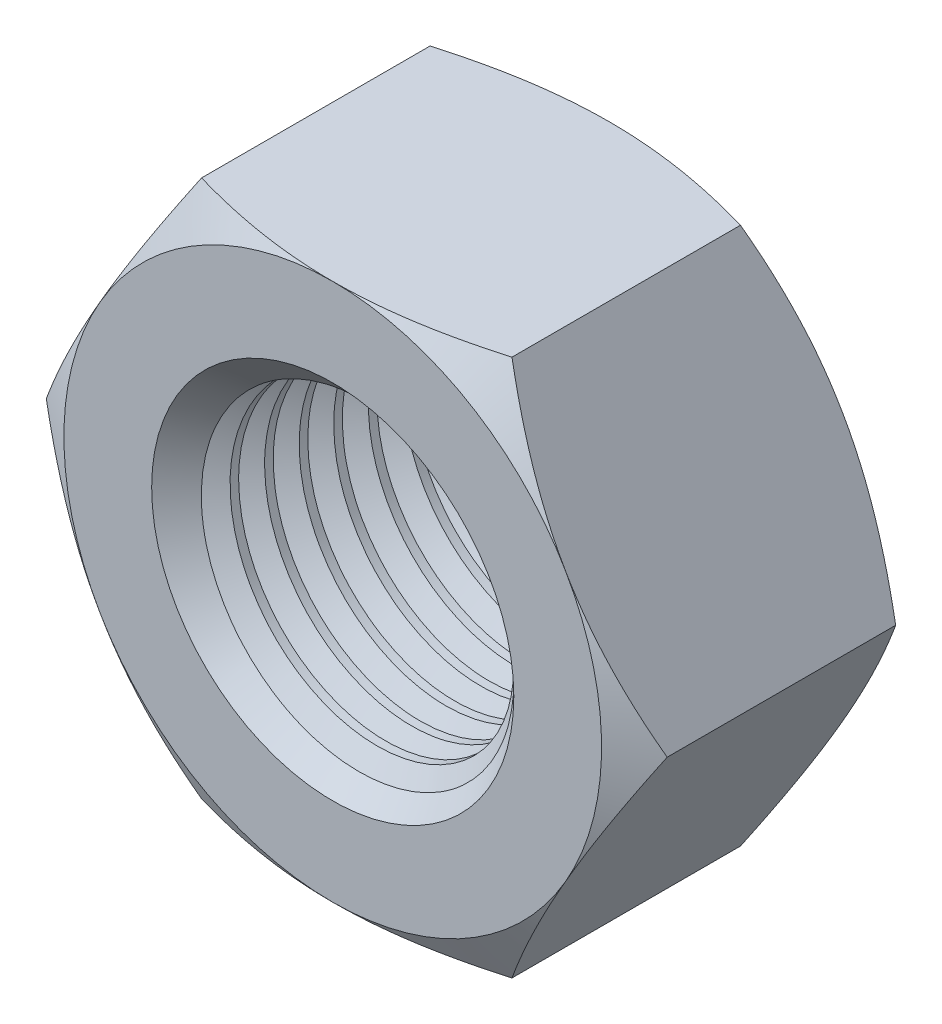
from build123d import *

# Parameters (mm, degrees)
Y_KSEKLIK_EKSTR_ZYON1_DEPTH = 36
IZIM2_OUTSIDE_W             = 230.102
IZIM2_OUTSIDE_H             = 219.27199999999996
IZIM2_OUTSIDE_R             = 35.00000000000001
KES_EKSTR_ZYON1_DEPTH       = 36
KES_EKSTR_ZYON1_DRAFT       = -60.000000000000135
IZIM3_OUTSIDE_W             = 230.102
IZIM3_OUTSIDE_H             = 219.27199999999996
IZIM3_OUTSIDE_R             = 35.00000000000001
KES_EKSTR_ZYON2_DEPTH       = 36
KES_EKSTR_ZYON2_DRAFT       = -60.000000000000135
IZIM4_R                     = 19.575
KES_EKSTR_ZYON3_DEPTH       = 36
PAH1_SIZE                   = 4
KES_S_P_R1_PITCH            = 4.499999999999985
KES_S_P_R1_HEIGHT           = 39.99999999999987
KES_S_P_R1_RADIUS           = 19.575
KES_S_P_R1_START_ANGLE      = -4.0009e-13


with BuildPart() as part:
    # izim1 → Y_kseklik-Ekstr_zyon1 (new body)
    with BuildSketch(Plane.XY):
        Polygon((40.414518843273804, 9.8e-15), (20.207259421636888, 35), (-20.2072594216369, 35), (-40.41451884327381, 4.5e-16), (-20.20725942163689, -35), (20.20725942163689, -35), align=None)
    extrude(amount=Y_KSEKLIK_EKSTR_ZYON1_DEPTH)


with BuildPart() as kes_ekstr_zyon1_tool:
    # izim2 outside → Kes-Ekstr_zyon1 (with draft: the straight prism first)
    with BuildSketch(Plane.XY.offset(36)):
        Rectangle(IZIM2_OUTSIDE_W, IZIM2_OUTSIDE_H)
        Circle(IZIM2_OUTSIDE_R, mode=Mode.SUBTRACT)
    extrude(amount=-KES_EKSTR_ZYON1_DEPTH)
    # Kes-Ekstr_zyon1: the draft: its side faces are tilted about the plane it starts from
    kes_ekstr_zyon1_sides = [kes_ekstr_zyon1_tool.faces().sort_by_distance(p)[0] for p in [
        (0, -109.636, 18),
        (115.051, 0, 18),
        (0, 109.636, 18),
        (-115.051, 0, 18),
        (-35, 0, 18),
    ]]
    draft(kes_ekstr_zyon1_sides, Plane.XY.offset(36), KES_EKSTR_ZYON1_DRAFT)


with BuildPart() as part_1:
    add(part.part)

    # Kes-Ekstr_zyon1: cut by kes_ekstr_zyon1_tool
    add(kes_ekstr_zyon1_tool.part, mode=Mode.SUBTRACT)


with BuildPart() as kes_ekstr_zyon2_tool:
    # izim3 outside → Kes-Ekstr_zyon2 (with draft: the straight prism first)
    with BuildSketch(Plane(origin=(0, 0, 0), x_dir=(-1, 0, 0), z_dir=(0, 0, -1))):
        Rectangle(IZIM3_OUTSIDE_W, IZIM3_OUTSIDE_H)
        Circle(IZIM3_OUTSIDE_R, mode=Mode.SUBTRACT)
    extrude(amount=-KES_EKSTR_ZYON2_DEPTH)
    # Kes-Ekstr_zyon2: the draft: its side faces are tilted about the plane it starts from
    kes_ekstr_zyon2_sides = [kes_ekstr_zyon2_tool.faces().sort_by_distance(p)[0] for p in [
        (0, -109.636, 18),
        (-115.051, 0, 18),
        (0, 109.636, 18),
        (115.051, 0, 18),
        (35, 0, 18),
    ]]
    draft(kes_ekstr_zyon2_sides, Plane(origin=(0, 0, 0), x_dir=(-1, 0, 0), z_dir=(0, 0, -1)), KES_EKSTR_ZYON2_DRAFT)


with BuildPart() as part_2:
    add(part_1.part)

    # Kes-Ekstr_zyon2: cut by kes_ekstr_zyon2_tool
    add(kes_ekstr_zyon2_tool.part, mode=Mode.SUBTRACT)

    # izim4 → Kes-Ekstr_zyon3 (cut)
    with BuildSketch(Plane(origin=(0, 0, 0), x_dir=(-1, 0, 0), z_dir=(0, 0, -1))):
        Circle(IZIM4_R)
    extrude(amount=-KES_EKSTR_ZYON3_DEPTH, mode=Mode.SUBTRACT)

    # Pah1
    pah1_edges = [part_2.edges().sort_by_distance(p)[0] for p in [
        (19.575, 2.4e-15, 36),
        (19.575, 2.4e-15, 0),
    ]]
    chamfer(pah1_edges, length=PAH1_SIZE)

    # Kes-S_p_r1: sweep along a helix
    with BuildLine() as kes_s_p_r1_path:
        add(Helix(KES_S_P_R1_PITCH, KES_S_P_R1_HEIGHT, KES_S_P_R1_RADIUS, center=(0, 0, 36), direction=(0, 0, -1), mode=Mode.PRIVATE).rotate(Axis((0, 0, 36), (0, 0, -1)), KES_S_P_R1_START_ANGLE))
    with BuildLine() as kes_s_p_r1_axis:
        Line((0, 0, 36), (0, 0, -3.999999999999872))
    # izim6 → Kes-S_p_r1 (sweep, cut)
    with BuildSketch(Plane(origin=(-14.99531997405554, -12.58256745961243, -3.9999999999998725), x_dir=(0.7664048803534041, 0.6416264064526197, -0.030644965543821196), z_dir=(-0.6423578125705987, 0.7655322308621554, -0.036562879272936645))):
        Polygon((0.965087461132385, 2.245943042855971), (0.9650874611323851, -2.2459430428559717), (-2.9250000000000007, 0), align=None)
    sweep(path=kes_s_p_r1_path.line, binormal=kes_s_p_r1_axis.edges()[0], mode=Mode.SUBTRACT)


solid = part_2.part
